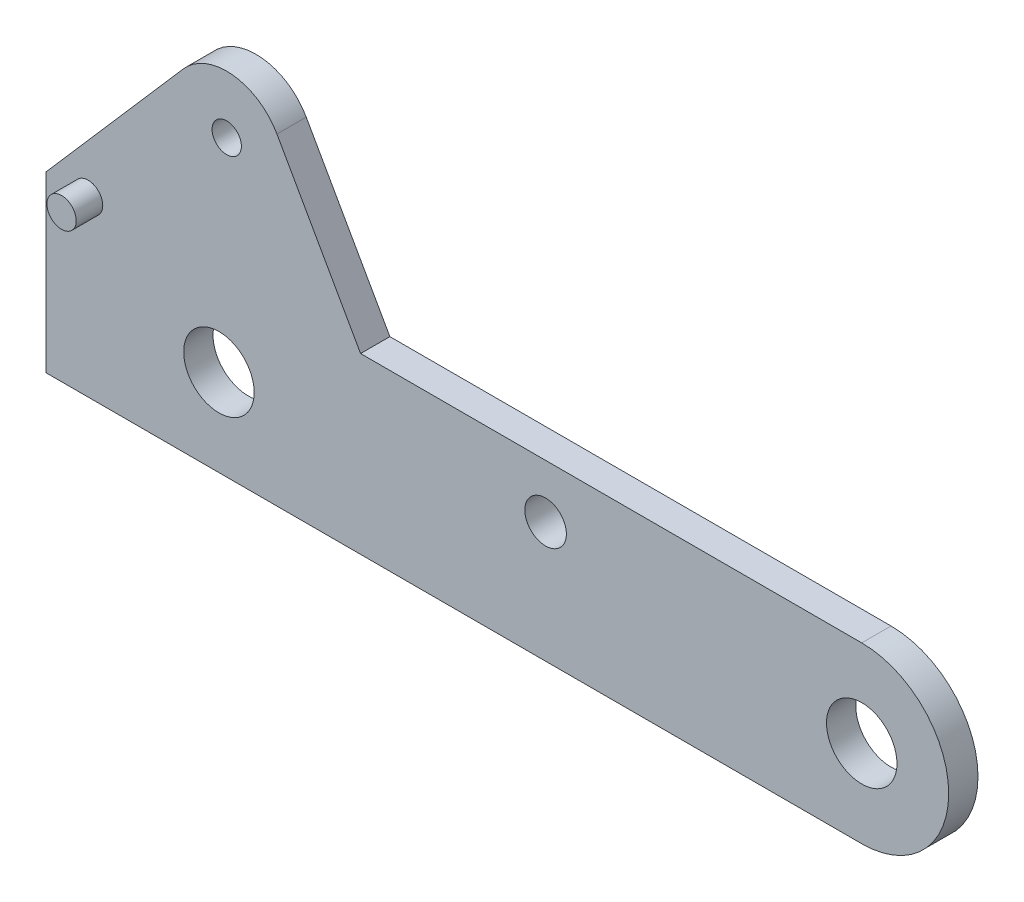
ISO-10303-21;
HEADER;
FILE_DESCRIPTION(('STEP AP214'),'2;1');
FILE_NAME('part.step','',(''),(''),'','','');
FILE_SCHEMA(('AUTOMOTIVE_DESIGN { 1 0 10303 214 1 1 1 1 }'));
ENDSEC;
DATA;
#1=APPLICATION_CONTEXT('core data for automotive mechanical design processes');
#2=APPLICATION_PROTOCOL_DEFINITION('international standard','automotive_design',2000,#1);
#3=PRODUCT_CONTEXT('',#1,'mechanical');
#4=PRODUCT('Part','Part','',(#3));
#5=PRODUCT_RELATED_PRODUCT_CATEGORY('part','',(#4));
#6=PRODUCT_DEFINITION_FORMATION('','',#4);
#7=PRODUCT_DEFINITION_CONTEXT('part definition',#1,'design');
#8=PRODUCT_DEFINITION('design','',#6,#7);
#9=PRODUCT_DEFINITION_SHAPE('','',#8);
#10=(LENGTH_UNIT() NAMED_UNIT(*) SI_UNIT(.MILLI.,.METRE.));
#11=(NAMED_UNIT(*) PLANE_ANGLE_UNIT() SI_UNIT($,.RADIAN.));
#12=(NAMED_UNIT(*) SI_UNIT($,.STERADIAN.) SOLID_ANGLE_UNIT());
#13=UNCERTAINTY_MEASURE_WITH_UNIT(LENGTH_MEASURE(1.E-05),#10,'distance_accuracy_value','');
#14=(GEOMETRIC_REPRESENTATION_CONTEXT(3) GLOBAL_UNCERTAINTY_ASSIGNED_CONTEXT((#13)) GLOBAL_UNIT_ASSIGNED_CONTEXT((#10,
#11,#12)) REPRESENTATION_CONTEXT('',''));
#15=CARTESIAN_POINT('',(0.,0.,0.));
#16=DIRECTION('',(0.,0.,1.));
#17=DIRECTION('',(1.,0.,0.));
#18=AXIS2_PLACEMENT_3D('',#15,#16,#17);
#19=CARTESIAN_POINT('',(9.86952098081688,16.05,0.8));
#20=DIRECTION('',(0.,0.,1.));
#21=DIRECTION('',(1.,0.,0.));
#22=AXIS2_PLACEMENT_3D('',#19,#20,#21);
#23=PLANE('',#22);
#24=CARTESIAN_POINT('',(9.86952098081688,16.05,0.8));
#25=DIRECTION('',(0.,0.,1.));
#26=DIRECTION('',(1.,0.,0.));
#27=AXIS2_PLACEMENT_3D('',#24,#25,#26);
#28=CIRCLE('',#27,0.799999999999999);
#29=CARTESIAN_POINT('',(10.6695209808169,16.05,0.8));
#30=VERTEX_POINT('',#29);
#31=EDGE_CURVE('E174',#30,#30,#28,.T.);
#32=ORIENTED_EDGE('',*,*,#31,.F.);
#33=EDGE_LOOP('',(#32));
#34=FACE_BOUND('',#33,.T.);
#35=CARTESIAN_POINT('',(44.55,4.75,0.8));
#36=DIRECTION('',(0.,0.,1.));
#37=DIRECTION('',(1.,0.,0.));
#38=AXIS2_PLACEMENT_3D('',#35,#36,#37);
#39=CIRCLE('',#38,1.925);
#40=CARTESIAN_POINT('',(46.475,4.75,0.8));
#41=VERTEX_POINT('',#40);
#42=EDGE_CURVE('E164',#41,#41,#39,.T.);
#43=ORIENTED_EDGE('',*,*,#42,.F.);
#44=EDGE_LOOP('',(#43));
#45=FACE_BOUND('',#44,.T.);
#46=DIRECTION('',(1.,0.,0.));
#47=VECTOR('',#46,1.);
#48=CARTESIAN_POINT('',(44.55,0.,0.8));
#49=LINE('',#48,#47);
#50=CARTESIAN_POINT('',(0.,0.,0.8));
#51=VERTEX_POINT('',#50);
#52=CARTESIAN_POINT('',(44.55,0.,0.8));
#53=VERTEX_POINT('',#52);
#54=EDGE_CURVE('E138',#51,#53,#49,.T.);
#55=ORIENTED_EDGE('',*,*,#54,.T.);
#56=CARTESIAN_POINT('',(44.55,4.75,0.8));
#57=DIRECTION('',(0.,0.,1.));
#58=DIRECTION('',(-1.,0.,0.));
#59=AXIS2_PLACEMENT_3D('',#56,#57,#58);
#60=CIRCLE('',#59,4.75);
#61=CARTESIAN_POINT('',(44.55,9.5,0.8));
#62=VERTEX_POINT('',#61);
#63=EDGE_CURVE('E91',#53,#62,#60,.T.);
#64=ORIENTED_EDGE('',*,*,#63,.T.);
#65=DIRECTION('',(-1.,0.,0.));
#66=VECTOR('',#65,1.);
#67=CARTESIAN_POINT('',(17.18,9.5,0.8));
#68=LINE('',#67,#66);
#69=CARTESIAN_POINT('',(17.18,9.5,0.8));
#70=VERTEX_POINT('',#69);
#71=EDGE_CURVE('E150',#62,#70,#68,.T.);
#72=ORIENTED_EDGE('',*,*,#71,.T.);
#73=DIRECTION('',(-0.491238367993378,0.871025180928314,0.));
#74=VECTOR('',#73,1.);
#75=CARTESIAN_POINT('',(12.6132503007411,17.5974008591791,0.8));
#76=LINE('',#75,#74);
#77=CARTESIAN_POINT('',(12.6132503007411,17.5974008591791,0.8));
#78=VERTEX_POINT('',#77);
#79=EDGE_CURVE('E107',#70,#78,#76,.T.);
#80=ORIENTED_EDGE('',*,*,#79,.T.);
#81=CARTESIAN_POINT('',(9.86952098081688,16.05,0.8));
#82=DIRECTION('',(0.,0.,1.));
#83=DIRECTION('',(1.,0.,0.));
#84=AXIS2_PLACEMENT_3D('',#81,#82,#83);
#85=CIRCLE('',#84,3.15);
#86=CARTESIAN_POINT('',(7.49244560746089,18.1168847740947,0.8));
#87=VERTEX_POINT('',#86);
#88=EDGE_CURVE('E101',#78,#87,#85,.T.);
#89=ORIENTED_EDGE('',*,*,#88,.T.);
#90=DIRECTION('',(-0.656153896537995,-0.754627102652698,0.));
#91=VECTOR('',#90,1.);
#92=CARTESIAN_POINT('',(0.,9.5,0.8));
#93=LINE('',#92,#91);
#94=CARTESIAN_POINT('',(0.,9.5,0.8));
#95=VERTEX_POINT('',#94);
#96=EDGE_CURVE('E105',#87,#95,#93,.T.);
#97=ORIENTED_EDGE('',*,*,#96,.T.);
#98=DIRECTION('',(0.,-1.,0.));
#99=VECTOR('',#98,1.);
#100=CARTESIAN_POINT('',(0.,0.,0.8));
#101=LINE('',#100,#99);
#102=EDGE_CURVE('E51',#95,#51,#101,.T.);
#103=ORIENTED_EDGE('',*,*,#102,.T.);
#104=EDGE_LOOP('',(#55,#64,#72,#80,#89,#97,#103));
#105=FACE_BOUND('',#104,.T.);
#106=CARTESIAN_POINT('',(2.3,9.45999999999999,0.8));
#107=DIRECTION('',(0.,0.,1.));
#108=DIRECTION('',(1.,0.,0.));
#109=AXIS2_PLACEMENT_3D('',#106,#107,#108);
#110=CIRCLE('',#109,0.8);
#111=CARTESIAN_POINT('',(3.1,9.45999999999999,0.8));
#112=VERTEX_POINT('',#111);
#113=EDGE_CURVE('E129',#112,#112,#110,.T.);
#114=ORIENTED_EDGE('',*,*,#113,.F.);
#115=EDGE_LOOP('',(#114));
#116=FACE_BOUND('',#115,.T.);
#117=CARTESIAN_POINT('',(9.445,4.75,0.8));
#118=DIRECTION('',(0.,0.,1.));
#119=DIRECTION('',(1.,0.,0.));
#120=AXIS2_PLACEMENT_3D('',#117,#118,#119);
#121=CIRCLE('',#120,1.925);
#122=CARTESIAN_POINT('',(11.37,4.75,0.8));
#123=VERTEX_POINT('',#122);
#124=EDGE_CURVE('E168',#123,#123,#121,.T.);
#125=ORIENTED_EDGE('',*,*,#124,.F.);
#126=EDGE_LOOP('',(#125));
#127=FACE_BOUND('',#126,.T.);
#128=CARTESIAN_POINT('',(27.285,6.585,0.8));
#129=DIRECTION('',(0.,0.,1.));
#130=DIRECTION('',(1.,0.,0.));
#131=AXIS2_PLACEMENT_3D('',#128,#129,#130);
#132=CIRCLE('',#131,1.135);
#133=CARTESIAN_POINT('',(28.42,6.585,0.8));
#134=VERTEX_POINT('',#133);
#135=EDGE_CURVE('E180',#134,#134,#132,.T.);
#136=ORIENTED_EDGE('',*,*,#135,.F.);
#137=EDGE_LOOP('',(#136));
#138=FACE_BOUND('',#137,.T.);
#139=ADVANCED_FACE('F34',(#34,#45,#105,#116,#127,#138),#23,.T.);
#140=CARTESIAN_POINT('',(9.86952098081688,16.05,-0.8));
#141=DIRECTION('',(0.,0.,1.));
#142=DIRECTION('',(1.,0.,0.));
#143=AXIS2_PLACEMENT_3D('',#140,#141,#142);
#144=PLANE('',#143);
#145=CARTESIAN_POINT('',(9.86952098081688,16.05,-0.8));
#146=DIRECTION('',(0.,0.,1.));
#147=DIRECTION('',(1.,0.,0.));
#148=AXIS2_PLACEMENT_3D('',#145,#146,#147);
#149=CIRCLE('',#148,0.799999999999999);
#150=CARTESIAN_POINT('',(10.6695209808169,16.05,-0.8));
#151=VERTEX_POINT('',#150);
#152=EDGE_CURVE('E177',#151,#151,#149,.T.);
#153=ORIENTED_EDGE('',*,*,#152,.T.);
#154=EDGE_LOOP('',(#153));
#155=FACE_BOUND('',#154,.T.);
#156=CARTESIAN_POINT('',(44.55,4.75,-0.8));
#157=DIRECTION('',(0.,0.,1.));
#158=DIRECTION('',(1.,0.,0.));
#159=AXIS2_PLACEMENT_3D('',#156,#157,#158);
#160=CIRCLE('',#159,1.925);
#161=CARTESIAN_POINT('',(46.475,4.75,-0.8));
#162=VERTEX_POINT('',#161);
#163=EDGE_CURVE('E165',#162,#162,#160,.T.);
#164=ORIENTED_EDGE('',*,*,#163,.T.);
#165=EDGE_LOOP('',(#164));
#166=FACE_BOUND('',#165,.T.);
#167=DIRECTION('',(1.,0.,0.));
#168=VECTOR('',#167,1.);
#169=CARTESIAN_POINT('',(44.55,0.,-0.8));
#170=LINE('',#169,#168);
#171=CARTESIAN_POINT('',(0.,0.,-0.8));
#172=VERTEX_POINT('',#171);
#173=CARTESIAN_POINT('',(44.55,0.,-0.8));
#174=VERTEX_POINT('',#173);
#175=EDGE_CURVE('E125',#172,#174,#170,.T.);
#176=ORIENTED_EDGE('',*,*,#175,.F.);
#177=DIRECTION('',(0.,-1.,0.));
#178=VECTOR('',#177,1.);
#179=CARTESIAN_POINT('',(0.,0.,-0.8));
#180=LINE('',#179,#178);
#181=CARTESIAN_POINT('',(0.,9.5,-0.8));
#182=VERTEX_POINT('',#181);
#183=EDGE_CURVE('E83',#182,#172,#180,.T.);
#184=ORIENTED_EDGE('',*,*,#183,.F.);
#185=DIRECTION('',(-0.656153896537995,-0.754627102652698,0.));
#186=VECTOR('',#185,1.);
#187=CARTESIAN_POINT('',(0.,9.5,-0.8));
#188=LINE('',#187,#186);
#189=CARTESIAN_POINT('',(7.49244560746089,18.1168847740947,-0.8));
#190=VERTEX_POINT('',#189);
#191=EDGE_CURVE('E77',#190,#182,#188,.T.);
#192=ORIENTED_EDGE('',*,*,#191,.F.);
#193=CARTESIAN_POINT('',(9.86952098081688,16.05,-0.8));
#194=DIRECTION('',(0.,0.,1.));
#195=DIRECTION('',(1.,0.,0.));
#196=AXIS2_PLACEMENT_3D('',#193,#194,#195);
#197=CIRCLE('',#196,3.15);
#198=CARTESIAN_POINT('',(12.6132503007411,17.5974008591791,-0.8));
#199=VERTEX_POINT('',#198);
#200=EDGE_CURVE('E115',#199,#190,#197,.T.);
#201=ORIENTED_EDGE('',*,*,#200,.F.);
#202=DIRECTION('',(-0.491238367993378,0.871025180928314,0.));
#203=VECTOR('',#202,1.);
#204=CARTESIAN_POINT('',(12.6132503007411,17.5974008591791,-0.8));
#205=LINE('',#204,#203);
#206=CARTESIAN_POINT('',(17.18,9.5,-0.8));
#207=VERTEX_POINT('',#206);
#208=EDGE_CURVE('E133',#207,#199,#205,.T.);
#209=ORIENTED_EDGE('',*,*,#208,.F.);
#210=DIRECTION('',(-1.,0.,0.));
#211=VECTOR('',#210,1.);
#212=CARTESIAN_POINT('',(17.18,9.5,-0.8));
#213=LINE('',#212,#211);
#214=CARTESIAN_POINT('',(44.55,9.5,-0.8));
#215=VERTEX_POINT('',#214);
#216=EDGE_CURVE('E131',#215,#207,#213,.T.);
#217=ORIENTED_EDGE('',*,*,#216,.F.);
#218=CARTESIAN_POINT('',(44.55,4.75,-0.8));
#219=DIRECTION('',(0.,0.,1.));
#220=DIRECTION('',(-1.,0.,0.));
#221=AXIS2_PLACEMENT_3D('',#218,#219,#220);
#222=CIRCLE('',#221,4.75);
#223=EDGE_CURVE('E128',#174,#215,#222,.T.);
#224=ORIENTED_EDGE('',*,*,#223,.F.);
#225=EDGE_LOOP('',(#176,#184,#192,#201,#209,#217,#224));
#226=FACE_BOUND('',#225,.T.);
#227=CARTESIAN_POINT('',(2.3,9.45999999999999,-0.8));
#228=DIRECTION('',(0.,0.,1.));
#229=DIRECTION('',(1.,0.,0.));
#230=AXIS2_PLACEMENT_3D('',#227,#228,#229);
#231=CIRCLE('',#230,0.8);
#232=CARTESIAN_POINT('',(3.1,9.45999999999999,-0.8));
#233=VERTEX_POINT('',#232);
#234=EDGE_CURVE('E186',#233,#233,#231,.F.);
#235=ORIENTED_EDGE('',*,*,#234,.F.);
#236=EDGE_LOOP('',(#235));
#237=FACE_BOUND('',#236,.T.);
#238=CARTESIAN_POINT('',(9.445,4.75,-0.8));
#239=DIRECTION('',(0.,0.,1.));
#240=DIRECTION('',(1.,0.,0.));
#241=AXIS2_PLACEMENT_3D('',#238,#239,#240);
#242=CIRCLE('',#241,1.925);
#243=CARTESIAN_POINT('',(11.37,4.75,-0.8));
#244=VERTEX_POINT('',#243);
#245=EDGE_CURVE('E171',#244,#244,#242,.T.);
#246=ORIENTED_EDGE('',*,*,#245,.T.);
#247=EDGE_LOOP('',(#246));
#248=FACE_BOUND('',#247,.T.);
#249=CARTESIAN_POINT('',(27.285,6.585,-0.8));
#250=DIRECTION('',(0.,0.,1.));
#251=DIRECTION('',(1.,0.,0.));
#252=AXIS2_PLACEMENT_3D('',#249,#250,#251);
#253=CIRCLE('',#252,1.135);
#254=CARTESIAN_POINT('',(28.42,6.585,-0.8));
#255=VERTEX_POINT('',#254);
#256=EDGE_CURVE('E183',#255,#255,#253,.T.);
#257=ORIENTED_EDGE('',*,*,#256,.T.);
#258=EDGE_LOOP('',(#257));
#259=FACE_BOUND('',#258,.T.);
#260=ADVANCED_FACE('F154',(#155,#166,#226,#237,#248,#259),#144,.F.);
#261=CARTESIAN_POINT('',(44.55,0.,0.8));
#262=DIRECTION('',(0.,1.,0.));
#263=DIRECTION('',(-1.,0.,0.));
#264=AXIS2_PLACEMENT_3D('',#261,#262,#263);
#265=PLANE('',#264);
#266=ORIENTED_EDGE('',*,*,#175,.T.);
#267=DIRECTION('',(0.,0.,-1.));
#268=VECTOR('',#267,1.);
#269=CARTESIAN_POINT('',(44.55,0.,0.8));
#270=LINE('',#269,#268);
#271=EDGE_CURVE('E11',#53,#174,#270,.T.);
#272=ORIENTED_EDGE('',*,*,#271,.F.);
#273=ORIENTED_EDGE('',*,*,#54,.F.);
#274=DIRECTION('',(0.,0.,-1.));
#275=VECTOR('',#274,1.);
#276=CARTESIAN_POINT('',(0.,0.,0.8));
#277=LINE('',#276,#275);
#278=EDGE_CURVE('E121',#51,#172,#277,.T.);
#279=ORIENTED_EDGE('',*,*,#278,.T.);
#280=EDGE_LOOP('',(#266,#272,#273,#279));
#281=FACE_BOUND('',#280,.T.);
#282=ADVANCED_FACE('F36',(#281),#265,.F.);
#283=CARTESIAN_POINT('',(44.55,4.75,0.8));
#284=DIRECTION('',(0.,0.,-1.));
#285=DIRECTION('',(-1.,0.,0.));
#286=AXIS2_PLACEMENT_3D('',#283,#284,#285);
#287=CYLINDRICAL_SURFACE('',#286,4.75);
#288=ORIENTED_EDGE('',*,*,#223,.T.);
#289=DIRECTION('',(0.,0.,-1.));
#290=VECTOR('',#289,1.);
#291=CARTESIAN_POINT('',(44.55,9.5,0.8));
#292=LINE('',#291,#290);
#293=EDGE_CURVE('E43',#62,#215,#292,.T.);
#294=ORIENTED_EDGE('',*,*,#293,.F.);
#295=ORIENTED_EDGE('',*,*,#63,.F.);
#296=ORIENTED_EDGE('',*,*,#271,.T.);
#297=EDGE_LOOP('',(#288,#294,#295,#296));
#298=FACE_BOUND('',#297,.T.);
#299=ADVANCED_FACE('F238',(#298),#287,.T.);
#300=CARTESIAN_POINT('',(17.18,9.5,0.8));
#301=DIRECTION('',(0.,-1.,0.));
#302=DIRECTION('',(1.,0.,0.));
#303=AXIS2_PLACEMENT_3D('',#300,#301,#302);
#304=PLANE('',#303);
#305=ORIENTED_EDGE('',*,*,#216,.T.);
#306=DIRECTION('',(0.,0.,-1.));
#307=VECTOR('',#306,1.);
#308=CARTESIAN_POINT('',(17.18,9.5,0.8));
#309=LINE('',#308,#307);
#310=EDGE_CURVE('E142',#70,#207,#309,.T.);
#311=ORIENTED_EDGE('',*,*,#310,.F.);
#312=ORIENTED_EDGE('',*,*,#71,.F.);
#313=ORIENTED_EDGE('',*,*,#293,.T.);
#314=EDGE_LOOP('',(#305,#311,#312,#313));
#315=FACE_BOUND('',#314,.T.);
#316=ADVANCED_FACE('F148',(#315),#304,.F.);
#317=CARTESIAN_POINT('',(12.6132503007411,17.5974008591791,0.8));
#318=DIRECTION('',(-0.871025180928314,-0.491238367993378,0.));
#319=DIRECTION('',(0.491238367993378,-0.871025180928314,0.));
#320=AXIS2_PLACEMENT_3D('',#317,#318,#319);
#321=PLANE('',#320);
#322=ORIENTED_EDGE('',*,*,#208,.T.);
#323=DIRECTION('',(0.,0.,-1.));
#324=VECTOR('',#323,1.);
#325=CARTESIAN_POINT('',(12.6132503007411,17.5974008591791,0.8));
#326=LINE('',#325,#324);
#327=EDGE_CURVE('E116',#78,#199,#326,.T.);
#328=ORIENTED_EDGE('',*,*,#327,.F.);
#329=ORIENTED_EDGE('',*,*,#79,.F.);
#330=ORIENTED_EDGE('',*,*,#310,.T.);
#331=EDGE_LOOP('',(#322,#328,#329,#330));
#332=FACE_BOUND('',#331,.T.);
#333=ADVANCED_FACE('F157',(#332),#321,.F.);
#334=CARTESIAN_POINT('',(9.86952098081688,16.05,0.8));
#335=DIRECTION('',(0.,0.,-1.));
#336=DIRECTION('',(-1.,0.,0.));
#337=AXIS2_PLACEMENT_3D('',#334,#335,#336);
#338=CYLINDRICAL_SURFACE('',#337,3.15);
#339=ORIENTED_EDGE('',*,*,#200,.T.);
#340=DIRECTION('',(0.,0.,-1.));
#341=VECTOR('',#340,1.);
#342=CARTESIAN_POINT('',(7.49244560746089,18.1168847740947,0.8));
#343=LINE('',#342,#341);
#344=EDGE_CURVE('E112',#87,#190,#343,.T.);
#345=ORIENTED_EDGE('',*,*,#344,.F.);
#346=ORIENTED_EDGE('',*,*,#88,.F.);
#347=ORIENTED_EDGE('',*,*,#327,.T.);
#348=EDGE_LOOP('',(#339,#345,#346,#347));
#349=FACE_BOUND('',#348,.T.);
#350=ADVANCED_FACE('F113',(#349),#338,.T.);
#351=CARTESIAN_POINT('',(0.,9.5,0.8));
#352=DIRECTION('',(0.754627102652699,-0.656153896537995,0.));
#353=DIRECTION('',(0.656153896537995,0.754627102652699,0.));
#354=AXIS2_PLACEMENT_3D('',#351,#352,#353);
#355=PLANE('',#354);
#356=ORIENTED_EDGE('',*,*,#191,.T.);
#357=DIRECTION('',(0.,0.,-1.));
#358=VECTOR('',#357,1.);
#359=CARTESIAN_POINT('',(0.,9.5,0.8));
#360=LINE('',#359,#358);
#361=EDGE_CURVE('E117',#95,#182,#360,.T.);
#362=ORIENTED_EDGE('',*,*,#361,.F.);
#363=ORIENTED_EDGE('',*,*,#96,.F.);
#364=ORIENTED_EDGE('',*,*,#344,.T.);
#365=EDGE_LOOP('',(#356,#362,#363,#364));
#366=FACE_BOUND('',#365,.T.);
#367=ADVANCED_FACE('F119',(#366),#355,.F.);
#368=CARTESIAN_POINT('',(0.,0.,0.8));
#369=DIRECTION('',(1.,0.,0.));
#370=DIRECTION('',(0.,0.,-1.));
#371=AXIS2_PLACEMENT_3D('',#368,#369,#370);
#372=PLANE('',#371);
#373=ORIENTED_EDGE('',*,*,#183,.T.);
#374=ORIENTED_EDGE('',*,*,#278,.F.);
#375=ORIENTED_EDGE('',*,*,#102,.F.);
#376=ORIENTED_EDGE('',*,*,#361,.T.);
#377=EDGE_LOOP('',(#373,#374,#375,#376));
#378=FACE_BOUND('',#377,.T.);
#379=ADVANCED_FACE('F228',(#378),#372,.F.);
#380=CARTESIAN_POINT('',(44.55,4.75,0.8));
#381=DIRECTION('',(0.,0.,-1.));
#382=DIRECTION('',(-1.,0.,0.));
#383=AXIS2_PLACEMENT_3D('',#380,#381,#382);
#384=CYLINDRICAL_SURFACE('',#383,1.925);
#385=ORIENTED_EDGE('',*,*,#42,.T.);
#386=EDGE_LOOP('',(#385));
#387=FACE_BOUND('',#386,.T.);
#388=ORIENTED_EDGE('',*,*,#163,.F.);
#389=EDGE_LOOP('',(#388));
#390=FACE_BOUND('',#389,.T.);
#391=ADVANCED_FACE('F225',(#387,#390),#384,.F.);
#392=CARTESIAN_POINT('',(9.445,4.75,0.8));
#393=DIRECTION('',(0.,0.,-1.));
#394=DIRECTION('',(-1.,0.,0.));
#395=AXIS2_PLACEMENT_3D('',#392,#393,#394);
#396=CYLINDRICAL_SURFACE('',#395,1.925);
#397=ORIENTED_EDGE('',*,*,#124,.T.);
#398=EDGE_LOOP('',(#397));
#399=FACE_BOUND('',#398,.T.);
#400=ORIENTED_EDGE('',*,*,#245,.F.);
#401=EDGE_LOOP('',(#400));
#402=FACE_BOUND('',#401,.T.);
#403=ADVANCED_FACE('F297',(#399,#402),#396,.F.);
#404=CARTESIAN_POINT('',(9.86952098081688,16.05,0.8));
#405=DIRECTION('',(0.,0.,-1.));
#406=DIRECTION('',(-1.,0.,0.));
#407=AXIS2_PLACEMENT_3D('',#404,#405,#406);
#408=CYLINDRICAL_SURFACE('',#407,0.799999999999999);
#409=ORIENTED_EDGE('',*,*,#31,.T.);
#410=EDGE_LOOP('',(#409));
#411=FACE_BOUND('',#410,.T.);
#412=ORIENTED_EDGE('',*,*,#152,.F.);
#413=EDGE_LOOP('',(#412));
#414=FACE_BOUND('',#413,.T.);
#415=ADVANCED_FACE('F305',(#411,#414),#408,.F.);
#416=CARTESIAN_POINT('',(27.285,6.585,0.8));
#417=DIRECTION('',(0.,0.,-1.));
#418=DIRECTION('',(-1.,0.,0.));
#419=AXIS2_PLACEMENT_3D('',#416,#417,#418);
#420=CYLINDRICAL_SURFACE('',#419,1.135);
#421=ORIENTED_EDGE('',*,*,#135,.T.);
#422=EDGE_LOOP('',(#421));
#423=FACE_BOUND('',#422,.T.);
#424=ORIENTED_EDGE('',*,*,#256,.F.);
#425=EDGE_LOOP('',(#424));
#426=FACE_BOUND('',#425,.T.);
#427=ADVANCED_FACE('F313',(#423,#426),#420,.F.);
#428=CARTESIAN_POINT('',(2.3,9.45999999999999,-2.25));
#429=DIRECTION('',(0.,0.,1.));
#430=DIRECTION('',(1.,0.,0.));
#431=AXIS2_PLACEMENT_3D('',#428,#429,#430);
#432=PLANE('',#431);
#433=CARTESIAN_POINT('',(2.3,9.45999999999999,-2.25));
#434=DIRECTION('',(0.,0.,1.));
#435=DIRECTION('',(1.,0.,0.));
#436=AXIS2_PLACEMENT_3D('',#433,#434,#435);
#437=CIRCLE('',#436,0.8);
#438=CARTESIAN_POINT('',(3.1,9.45999999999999,-2.25));
#439=VERTEX_POINT('',#438);
#440=EDGE_CURVE('E192',#439,#439,#437,.T.);
#441=ORIENTED_EDGE('',*,*,#440,.F.);
#442=EDGE_LOOP('',(#441));
#443=FACE_BOUND('',#442,.T.);
#444=ADVANCED_FACE('F210',(#443),#432,.F.);
#445=CARTESIAN_POINT('',(2.3,9.45999999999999,2.25));
#446=DIRECTION('',(0.,0.,-1.));
#447=DIRECTION('',(-1.,0.,0.));
#448=AXIS2_PLACEMENT_3D('',#445,#446,#447);
#449=CYLINDRICAL_SURFACE('',#448,0.8);
#450=ORIENTED_EDGE('',*,*,#440,.T.);
#451=EDGE_LOOP('',(#450));
#452=FACE_BOUND('',#451,.T.);
#453=ORIENTED_EDGE('',*,*,#234,.T.);
#454=EDGE_LOOP('',(#453));
#455=FACE_BOUND('',#454,.T.);
#456=ADVANCED_FACE('F202',(#452,#455),#449,.T.);
#457=ORIENTED_EDGE('',*,*,#113,.T.);
#458=EDGE_LOOP('',(#457));
#459=FACE_BOUND('',#458,.T.);
#460=CARTESIAN_POINT('',(2.3,9.45999999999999,2.25));
#461=DIRECTION('',(0.,0.,1.));
#462=DIRECTION('',(1.,0.,0.));
#463=AXIS2_PLACEMENT_3D('',#460,#461,#462);
#464=CIRCLE('',#463,0.8);
#465=CARTESIAN_POINT('',(3.1,9.45999999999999,2.25));
#466=VERTEX_POINT('',#465);
#467=EDGE_CURVE('E191',#466,#466,#464,.T.);
#468=ORIENTED_EDGE('',*,*,#467,.F.);
#469=EDGE_LOOP('',(#468));
#470=FACE_BOUND('',#469,.T.);
#471=ADVANCED_FACE('F200',(#459,#470),#449,.T.);
#472=CARTESIAN_POINT('',(2.3,9.45999999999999,2.25));
#473=DIRECTION('',(0.,0.,1.));
#474=DIRECTION('',(1.,0.,0.));
#475=AXIS2_PLACEMENT_3D('',#472,#473,#474);
#476=PLANE('',#475);
#477=ORIENTED_EDGE('',*,*,#467,.T.);
#478=EDGE_LOOP('',(#477));
#479=FACE_BOUND('',#478,.T.);
#480=ADVANCED_FACE('F198',(#479),#476,.T.);
#481=CLOSED_SHELL('',(#139,#260,#282,#299,#316,#333,#350,#367,#379,#391,#403,#415,#427,#444,
#456,#471,#480));
#482=MANIFOLD_SOLID_BREP('B2',#481);
#483=ADVANCED_BREP_SHAPE_REPRESENTATION('',(#18,#482),#14);
#484=SHAPE_DEFINITION_REPRESENTATION(#9,#483);
ENDSEC;
END-ISO-10303-21;
